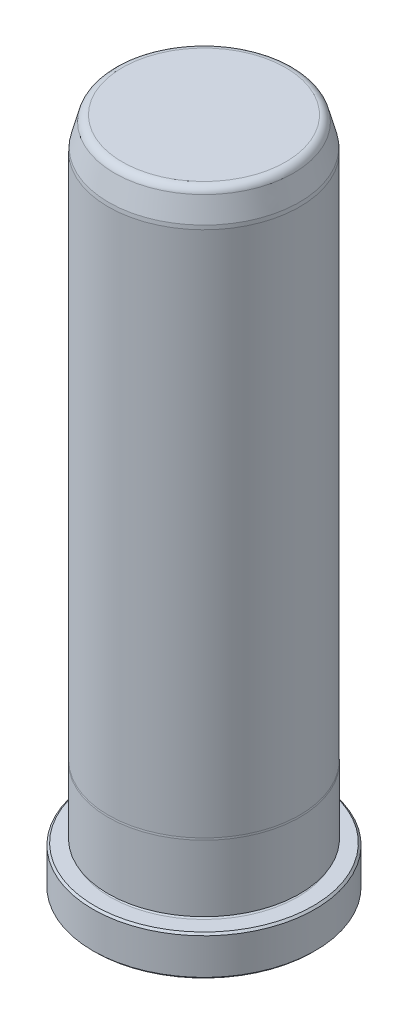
from build123d import *

# Parameters (mm, degrees)
FILLET6_R     = 1.5875
CHAMFER1_SIZE = 0.381


with BuildPart() as part:
    # Sketch1 → Revolve1 (revolve)
    with BuildSketch(Plane(origin=(0, 0, 0), x_dir=(0, 0, -1), z_dir=(1, 0, 0)), mode=Mode.PRIVATE) as revolve1_sk:
        with BuildLine():
            Line((0, 0), (22.098, 0))
            Line((22.098, 0), (22.098, 7.9248))
            Line((22.098, 7.9248), (18.6563, 7.9248))
            ThreePointArc((18.6563, 7.9248), (18.2753, 8.3058), (18.6563, 8.6868))
            Line((18.6563, 8.6868), (19.0627, 8.6868))
            Line((19.0627, 8.6868), (19.0627, 21.861763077))
            Line((19.0627, 21.861763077), (19.0373, 22.225))
            Line((19.0373, 22.225), (19.0373, 127))
            Line((19.0373, 127), (18.970633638, 127.762))
            Line((18.970633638, 127.762), (17.473333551, 133.35))
            Line((17.473333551, 133.35), (0, 133.35))
            Line((0, 133.35), (0, 0))
        make_face()
    revolve(revolve1_sk.sketch.rotate(Axis((0, 0, 0), (0, -1, 0)), 180), axis=Axis((0, 0, 0), (0, -1, 0)))

    # Fillet6
    fillet6_edges = [part.edges().sort_by_distance(p)[0] for p in [
        (0, 133.35, -17.473333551),
    ]]
    fillet(fillet6_edges, radius=FILLET6_R)

    # Chamfer1
    chamfer1_edges = [part.edges().sort_by_distance(p)[0] for p in [
        (0, 7.9248, -22.098),
        (0, 0, -22.098),
    ]]
    chamfer(chamfer1_edges, length=CHAMFER1_SIZE)


solid = part.part
